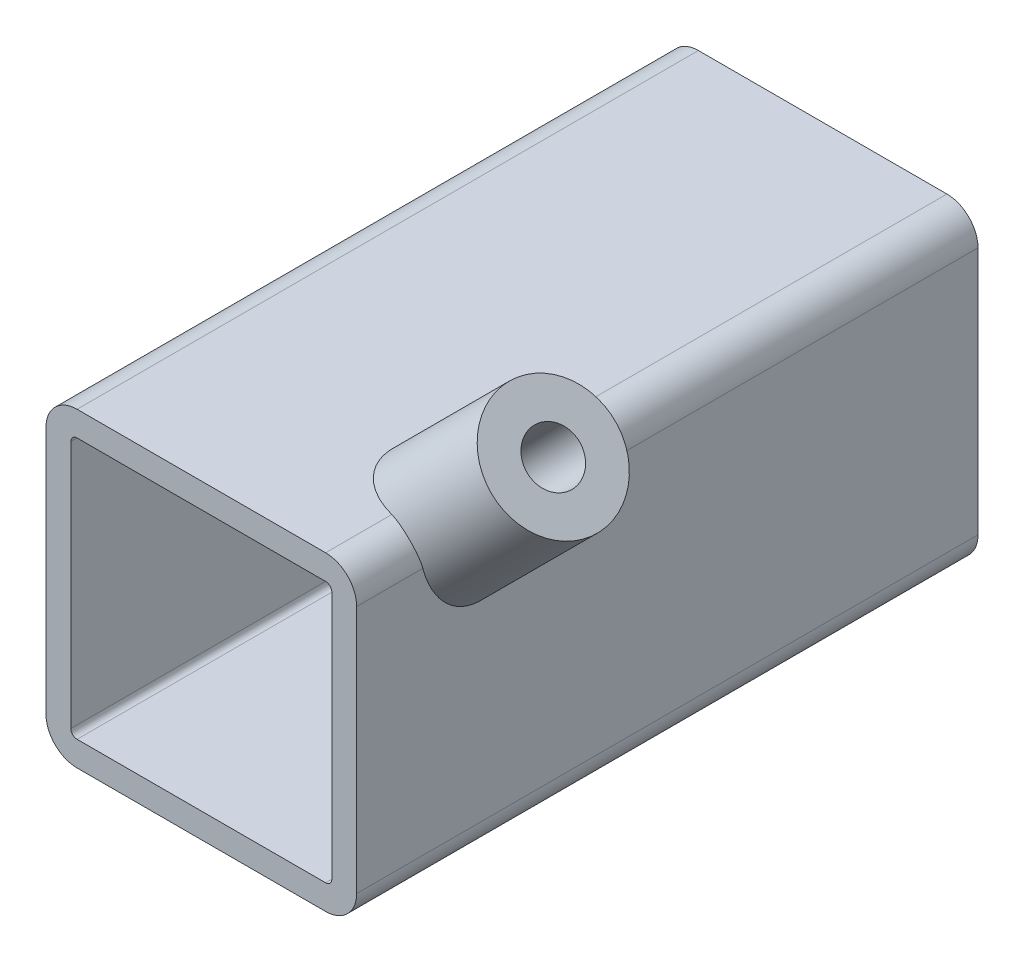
from build123d import *

# Parameters (mm, degrees)
BASE_EXTRUSION_DEPTH    = 100
BOSS_EXTRU_1_DEPTH      = 20
BOSS_EXTRU_1_DEPTH_BACK = 15
ESQUISSE2_R             = 10
ENL_V_MAT_EXTRU_1_DEPTH = 132.230729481
ESQUISSE4_R             = 4.25
ENL_V_MAT_EXTRU_2_DEPTH = 30


with BuildPart() as part:
    # Esquisse1 → Base-Extrusion (new body)
    with BuildSketch(Plane.XY):
        with BuildLine():
            Line((5, 0), (45, 0))
            ThreePointArc((45, 0), (48.535533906, -1.464466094), (50, -5))
            Line((50, -5), (50, -45))
            ThreePointArc((50, -45), (48.535533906, -48.535533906), (45, -50))
            Line((45, -50), (5, -50))
            ThreePointArc((5, -50), (1.464466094, -48.535533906), (0, -45))
            Line((0, -45), (0, -5))
            ThreePointArc((0, -5), (1.464466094, -1.464466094), (5, 0))
        make_face()
    extrude(amount=BASE_EXTRUSION_DEPTH)

    # Esquisse2 → Boss.-Extru.1 (add, two sides: drawn at the far end of the back side and taken through both)
    with BuildSketch(Plane(origin=(22.5, 22.5, 0), x_dir=(0, 0, -1), z_dir=(0.7071067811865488, 0.7071067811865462, 0)).offset(-BOSS_EXTRU_1_DEPTH_BACK)):
        with Locations(Location((-80, -35.355339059, 0), (0, 0, 200.704849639))):
            Circle(ESQUISSE2_R)
    extrude(amount=BOSS_EXTRU_1_DEPTH + BOSS_EXTRU_1_DEPTH_BACK)

    # Esquisse3 → Enl_v. mat.-Extru.1 (cut, through all)
    with BuildSketch(Plane.XY.offset(100)):
        with BuildLine():
            Line((46, -45), (46, -5))
            ThreePointArc((46, -5), (45.707106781, -4.292893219), (45, -4))
            Line((45, -4), (5, -4))
            ThreePointArc((5, -4), (4.292893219, -4.292893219), (4, -5))
            Line((4, -5), (4, -45))
            ThreePointArc((4, -45), (4.292893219, -45.707106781), (5, -46))
            Line((5, -46), (45, -46))
            ThreePointArc((45, -46), (45.707106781, -45.707106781), (46, -45))
        make_face()
    extrude(amount=-ENL_V_MAT_EXTRU_1_DEPTH, mode=Mode.SUBTRACT)

    # Esquisse4 → Enl_v. mat.-Extru.2 (cut)
    with BuildSketch(Plane(origin=(36.642135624, 36.642135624, 0), x_dir=(0, 0, -1), z_dir=(0.7071067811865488, 0.7071067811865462, 0))):
        with Locations(Location((-80, -35.355339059, 0), (0, 0, 90))):
            Circle(ESQUISSE4_R)
    extrude(amount=-ENL_V_MAT_EXTRU_2_DEPTH, mode=Mode.SUBTRACT)


solid = part.part
